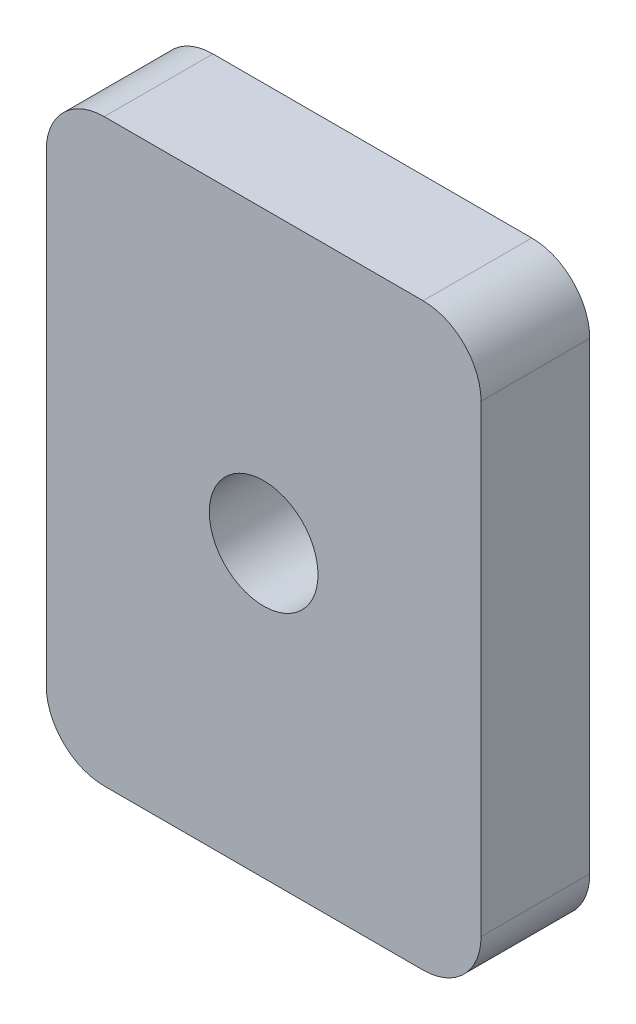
ISO-10303-21;
HEADER;
FILE_DESCRIPTION(('STEP AP214'),'2;1');
FILE_NAME('part.step','',(''),(''),'','','');
FILE_SCHEMA(('AUTOMOTIVE_DESIGN { 1 0 10303 214 1 1 1 1 }'));
ENDSEC;
DATA;
#1=APPLICATION_CONTEXT('core data for automotive mechanical design processes');
#2=APPLICATION_PROTOCOL_DEFINITION('international standard','automotive_design',2000,#1);
#3=PRODUCT_CONTEXT('',#1,'mechanical');
#4=PRODUCT('Part','Part','',(#3));
#5=PRODUCT_RELATED_PRODUCT_CATEGORY('part','',(#4));
#6=PRODUCT_DEFINITION_FORMATION('','',#4);
#7=PRODUCT_DEFINITION_CONTEXT('part definition',#1,'design');
#8=PRODUCT_DEFINITION('design','',#6,#7);
#9=PRODUCT_DEFINITION_SHAPE('','',#8);
#10=(LENGTH_UNIT() NAMED_UNIT(*) SI_UNIT(.MILLI.,.METRE.));
#11=(NAMED_UNIT(*) PLANE_ANGLE_UNIT() SI_UNIT($,.RADIAN.));
#12=(NAMED_UNIT(*) SI_UNIT($,.STERADIAN.) SOLID_ANGLE_UNIT());
#13=UNCERTAINTY_MEASURE_WITH_UNIT(LENGTH_MEASURE(1.E-05),#10,'distance_accuracy_value','');
#14=(GEOMETRIC_REPRESENTATION_CONTEXT(3) GLOBAL_UNCERTAINTY_ASSIGNED_CONTEXT((#13)) GLOBAL_UNIT_ASSIGNED_CONTEXT((#10,
#11,#12)) REPRESENTATION_CONTEXT('',''));
#15=CARTESIAN_POINT('',(0.,0.,0.));
#16=DIRECTION('',(0.,0.,1.));
#17=DIRECTION('',(1.,0.,0.));
#18=AXIS2_PLACEMENT_3D('',#15,#16,#17);
#19=CARTESIAN_POINT('',(0.,0.,4.7625));
#20=DIRECTION('',(0.,0.,-1.));
#21=DIRECTION('',(-1.,0.,0.));
#22=AXIS2_PLACEMENT_3D('',#19,#20,#21);
#23=PLANE('',#22);
#24=DIRECTION('',(0.,-1.,0.));
#25=VECTOR('',#24,1.);
#26=CARTESIAN_POINT('',(0.,0.,4.7625));
#27=LINE('',#26,#25);
#28=CARTESIAN_POINT('',(0.,22.86,4.7625));
#29=VERTEX_POINT('',#28);
#30=CARTESIAN_POINT('',(0.,2.54,4.7625));
#31=VERTEX_POINT('',#30);
#32=EDGE_CURVE('E136',#29,#31,#27,.T.);
#33=ORIENTED_EDGE('',*,*,#32,.T.);
#34=CARTESIAN_POINT('',(2.54,2.54,4.7625));
#35=DIRECTION('',(0.,0.,-1.));
#36=DIRECTION('',(-1.,0.,0.));
#37=AXIS2_PLACEMENT_3D('',#34,#35,#36);
#38=CIRCLE('',#37,2.54);
#39=CARTESIAN_POINT('',(2.54,0.,4.7625));
#40=VERTEX_POINT('',#39);
#41=EDGE_CURVE('E151',#31,#40,#38,.F.);
#42=ORIENTED_EDGE('',*,*,#41,.T.);
#43=DIRECTION('',(1.,0.,0.));
#44=VECTOR('',#43,1.);
#45=CARTESIAN_POINT('',(0.,0.,4.7625));
#46=LINE('',#45,#44);
#47=CARTESIAN_POINT('',(16.51,0.,4.7625));
#48=VERTEX_POINT('',#47);
#49=EDGE_CURVE('E118',#40,#48,#46,.T.);
#50=ORIENTED_EDGE('',*,*,#49,.T.);
#51=CARTESIAN_POINT('',(16.51,2.54,4.7625));
#52=DIRECTION('',(0.,0.,-1.));
#53=DIRECTION('',(-1.,0.,0.));
#54=AXIS2_PLACEMENT_3D('',#51,#52,#53);
#55=CIRCLE('',#54,2.54);
#56=CARTESIAN_POINT('',(19.05,2.54,4.7625));
#57=VERTEX_POINT('',#56);
#58=EDGE_CURVE('E149',#48,#57,#55,.F.);
#59=ORIENTED_EDGE('',*,*,#58,.T.);
#60=DIRECTION('',(0.,1.,0.));
#61=VECTOR('',#60,1.);
#62=CARTESIAN_POINT('',(19.05,0.,4.7625));
#63=LINE('',#62,#61);
#64=CARTESIAN_POINT('',(19.05,22.86,4.7625));
#65=VERTEX_POINT('',#64);
#66=EDGE_CURVE('E171',#57,#65,#63,.T.);
#67=ORIENTED_EDGE('',*,*,#66,.T.);
#68=CARTESIAN_POINT('',(16.51,22.86,4.7625));
#69=DIRECTION('',(0.,0.,-1.));
#70=DIRECTION('',(-1.,0.,0.));
#71=AXIS2_PLACEMENT_3D('',#68,#69,#70);
#72=CIRCLE('',#71,2.54);
#73=CARTESIAN_POINT('',(16.51,25.4,4.7625));
#74=VERTEX_POINT('',#73);
#75=EDGE_CURVE('E53',#65,#74,#72,.F.);
#76=ORIENTED_EDGE('',*,*,#75,.T.);
#77=DIRECTION('',(-1.,0.,0.));
#78=VECTOR('',#77,1.);
#79=CARTESIAN_POINT('',(0.,25.4,4.7625));
#80=LINE('',#79,#78);
#81=CARTESIAN_POINT('',(2.54,25.4,4.7625));
#82=VERTEX_POINT('',#81);
#83=EDGE_CURVE('E137',#74,#82,#80,.T.);
#84=ORIENTED_EDGE('',*,*,#83,.T.);
#85=CARTESIAN_POINT('',(2.54,22.86,4.7625));
#86=DIRECTION('',(0.,0.,-1.));
#87=DIRECTION('',(-1.,0.,0.));
#88=AXIS2_PLACEMENT_3D('',#85,#86,#87);
#89=CIRCLE('',#88,2.54);
#90=EDGE_CURVE('E147',#82,#29,#89,.F.);
#91=ORIENTED_EDGE('',*,*,#90,.T.);
#92=EDGE_LOOP('',(#33,#42,#50,#59,#67,#76,#84,#91));
#93=FACE_BOUND('',#92,.T.);
#94=CARTESIAN_POINT('',(9.525,12.7,4.7625));
#95=DIRECTION('',(0.,0.,1.));
#96=DIRECTION('',(1.,0.,0.));
#97=AXIS2_PLACEMENT_3D('',#94,#95,#96);
#98=CIRCLE('',#97,2.38125);
#99=CARTESIAN_POINT('',(7.14375,12.7,4.7625));
#100=VERTEX_POINT('',#99);
#101=EDGE_CURVE('E131',#100,#100,#98,.T.);
#102=ORIENTED_EDGE('',*,*,#101,.F.);
#103=EDGE_LOOP('',(#102));
#104=FACE_BOUND('',#103,.T.);
#105=ADVANCED_FACE('F33',(#93,#104),#23,.F.);
#106=CARTESIAN_POINT('',(0.,0.,0.));
#107=DIRECTION('',(0.,0.,-1.));
#108=DIRECTION('',(-1.,0.,0.));
#109=AXIS2_PLACEMENT_3D('',#106,#107,#108);
#110=PLANE('',#109);
#111=DIRECTION('',(1.,0.,0.));
#112=VECTOR('',#111,1.);
#113=CARTESIAN_POINT('',(0.,0.,0.));
#114=LINE('',#113,#112);
#115=CARTESIAN_POINT('',(2.54,0.,0.));
#116=VERTEX_POINT('',#115);
#117=CARTESIAN_POINT('',(16.51,0.,0.));
#118=VERTEX_POINT('',#117);
#119=EDGE_CURVE('E115',#116,#118,#114,.T.);
#120=ORIENTED_EDGE('',*,*,#119,.F.);
#121=CARTESIAN_POINT('',(2.54,2.54,0.));
#122=DIRECTION('',(0.,0.,-1.));
#123=DIRECTION('',(-1.,0.,0.));
#124=AXIS2_PLACEMENT_3D('',#121,#122,#123);
#125=CIRCLE('',#124,2.54);
#126=CARTESIAN_POINT('',(0.,2.54,0.));
#127=VERTEX_POINT('',#126);
#128=EDGE_CURVE('E98',#116,#127,#125,.T.);
#129=ORIENTED_EDGE('',*,*,#128,.T.);
#130=DIRECTION('',(0.,-1.,0.));
#131=VECTOR('',#130,1.);
#132=CARTESIAN_POINT('',(0.,0.,0.));
#133=LINE('',#132,#131);
#134=CARTESIAN_POINT('',(0.,22.86,0.));
#135=VERTEX_POINT('',#134);
#136=EDGE_CURVE('E126',#135,#127,#133,.T.);
#137=ORIENTED_EDGE('',*,*,#136,.F.);
#138=CARTESIAN_POINT('',(2.54,22.86,0.));
#139=DIRECTION('',(0.,0.,-1.));
#140=DIRECTION('',(-1.,0.,0.));
#141=AXIS2_PLACEMENT_3D('',#138,#139,#140);
#142=CIRCLE('',#141,2.54);
#143=CARTESIAN_POINT('',(2.54,25.4,0.));
#144=VERTEX_POINT('',#143);
#145=EDGE_CURVE('E140',#135,#144,#142,.T.);
#146=ORIENTED_EDGE('',*,*,#145,.T.);
#147=DIRECTION('',(-1.,0.,0.));
#148=VECTOR('',#147,1.);
#149=CARTESIAN_POINT('',(0.,25.4,0.));
#150=LINE('',#149,#148);
#151=CARTESIAN_POINT('',(16.51,25.4,0.));
#152=VERTEX_POINT('',#151);
#153=EDGE_CURVE('E129',#152,#144,#150,.T.);
#154=ORIENTED_EDGE('',*,*,#153,.F.);
#155=CARTESIAN_POINT('',(16.51,22.86,0.));
#156=DIRECTION('',(0.,0.,-1.));
#157=DIRECTION('',(-1.,0.,0.));
#158=AXIS2_PLACEMENT_3D('',#155,#156,#157);
#159=CIRCLE('',#158,2.54);
#160=CARTESIAN_POINT('',(19.05,22.86,0.));
#161=VERTEX_POINT('',#160);
#162=EDGE_CURVE('E119',#152,#161,#159,.T.);
#163=ORIENTED_EDGE('',*,*,#162,.T.);
#164=DIRECTION('',(0.,1.,0.));
#165=VECTOR('',#164,1.);
#166=CARTESIAN_POINT('',(19.05,0.,0.));
#167=LINE('',#166,#165);
#168=CARTESIAN_POINT('',(19.05,2.54,0.));
#169=VERTEX_POINT('',#168);
#170=EDGE_CURVE('E125',#169,#161,#167,.T.);
#171=ORIENTED_EDGE('',*,*,#170,.F.);
#172=CARTESIAN_POINT('',(16.51,2.54,0.));
#173=DIRECTION('',(0.,0.,-1.));
#174=DIRECTION('',(-1.,0.,0.));
#175=AXIS2_PLACEMENT_3D('',#172,#173,#174);
#176=CIRCLE('',#175,2.54);
#177=EDGE_CURVE('E109',#169,#118,#176,.T.);
#178=ORIENTED_EDGE('',*,*,#177,.T.);
#179=EDGE_LOOP('',(#120,#129,#137,#146,#154,#163,#171,#178));
#180=FACE_BOUND('',#179,.T.);
#181=CARTESIAN_POINT('',(9.525,12.7,0.));
#182=DIRECTION('',(0.,0.,1.));
#183=DIRECTION('',(1.,0.,0.));
#184=AXIS2_PLACEMENT_3D('',#181,#182,#183);
#185=CIRCLE('',#184,2.38125);
#186=CARTESIAN_POINT('',(7.14375,12.7,0.));
#187=VERTEX_POINT('',#186);
#188=EDGE_CURVE('E174',#187,#187,#185,.T.);
#189=ORIENTED_EDGE('',*,*,#188,.T.);
#190=EDGE_LOOP('',(#189));
#191=FACE_BOUND('',#190,.T.);
#192=ADVANCED_FACE('F122',(#180,#191),#110,.T.);
#193=CARTESIAN_POINT('',(0.,0.,4.7625));
#194=DIRECTION('',(1.,0.,0.));
#195=DIRECTION('',(0.,0.,-1.));
#196=AXIS2_PLACEMENT_3D('',#193,#194,#195);
#197=PLANE('',#196);
#198=ORIENTED_EDGE('',*,*,#136,.T.);
#199=DIRECTION('',(0.,0.,-1.));
#200=VECTOR('',#199,1.);
#201=CARTESIAN_POINT('',(0.,2.54,4.7625));
#202=LINE('',#201,#200);
#203=EDGE_CURVE('E103',#127,#31,#202,.F.);
#204=ORIENTED_EDGE('',*,*,#203,.T.);
#205=ORIENTED_EDGE('',*,*,#32,.F.);
#206=DIRECTION('',(0.,0.,-1.));
#207=VECTOR('',#206,1.);
#208=CARTESIAN_POINT('',(0.,22.86,4.7625));
#209=LINE('',#208,#207);
#210=EDGE_CURVE('E108',#29,#135,#209,.T.);
#211=ORIENTED_EDGE('',*,*,#210,.T.);
#212=EDGE_LOOP('',(#198,#204,#205,#211));
#213=FACE_BOUND('',#212,.T.);
#214=ADVANCED_FACE('F168',(#213),#197,.F.);
#215=CARTESIAN_POINT('',(0.,0.,4.7625));
#216=DIRECTION('',(0.,1.,0.));
#217=DIRECTION('',(0.,0.,1.));
#218=AXIS2_PLACEMENT_3D('',#215,#216,#217);
#219=PLANE('',#218);
#220=ORIENTED_EDGE('',*,*,#49,.F.);
#221=DIRECTION('',(0.,0.,-1.));
#222=VECTOR('',#221,1.);
#223=CARTESIAN_POINT('',(2.54,0.,4.7625));
#224=LINE('',#223,#222);
#225=EDGE_CURVE('E102',#40,#116,#224,.T.);
#226=ORIENTED_EDGE('',*,*,#225,.T.);
#227=ORIENTED_EDGE('',*,*,#119,.T.);
#228=DIRECTION('',(0.,0.,-1.));
#229=VECTOR('',#228,1.);
#230=CARTESIAN_POINT('',(16.51,0.,4.7625));
#231=LINE('',#230,#229);
#232=EDGE_CURVE('E120',#118,#48,#231,.F.);
#233=ORIENTED_EDGE('',*,*,#232,.T.);
#234=EDGE_LOOP('',(#220,#226,#227,#233));
#235=FACE_BOUND('',#234,.T.);
#236=ADVANCED_FACE('F114',(#235),#219,.F.);
#237=CARTESIAN_POINT('',(19.05,0.,4.7625));
#238=DIRECTION('',(-1.,0.,0.));
#239=DIRECTION('',(0.,0.,1.));
#240=AXIS2_PLACEMENT_3D('',#237,#238,#239);
#241=PLANE('',#240);
#242=ORIENTED_EDGE('',*,*,#66,.F.);
#243=DIRECTION('',(0.,0.,-1.));
#244=VECTOR('',#243,1.);
#245=CARTESIAN_POINT('',(19.05,2.54,4.7625));
#246=LINE('',#245,#244);
#247=EDGE_CURVE('E155',#57,#169,#246,.T.);
#248=ORIENTED_EDGE('',*,*,#247,.T.);
#249=ORIENTED_EDGE('',*,*,#170,.T.);
#250=DIRECTION('',(0.,0.,-1.));
#251=VECTOR('',#250,1.);
#252=CARTESIAN_POINT('',(19.05,22.86,4.7625));
#253=LINE('',#252,#251);
#254=EDGE_CURVE('E153',#161,#65,#253,.F.);
#255=ORIENTED_EDGE('',*,*,#254,.T.);
#256=EDGE_LOOP('',(#242,#248,#249,#255));
#257=FACE_BOUND('',#256,.T.);
#258=ADVANCED_FACE('F195',(#257),#241,.F.);
#259=CARTESIAN_POINT('',(0.,25.4,4.7625));
#260=DIRECTION('',(0.,-1.,0.));
#261=DIRECTION('',(0.,0.,-1.));
#262=AXIS2_PLACEMENT_3D('',#259,#260,#261);
#263=PLANE('',#262);
#264=ORIENTED_EDGE('',*,*,#153,.T.);
#265=DIRECTION('',(0.,0.,-1.));
#266=VECTOR('',#265,1.);
#267=CARTESIAN_POINT('',(2.54,25.4,4.7625));
#268=LINE('',#267,#266);
#269=EDGE_CURVE('E11',#144,#82,#268,.F.);
#270=ORIENTED_EDGE('',*,*,#269,.T.);
#271=ORIENTED_EDGE('',*,*,#83,.F.);
#272=DIRECTION('',(0.,0.,-1.));
#273=VECTOR('',#272,1.);
#274=CARTESIAN_POINT('',(16.51,25.4,4.7625));
#275=LINE('',#274,#273);
#276=EDGE_CURVE('E41',#74,#152,#275,.T.);
#277=ORIENTED_EDGE('',*,*,#276,.T.);
#278=EDGE_LOOP('',(#264,#270,#271,#277));
#279=FACE_BOUND('',#278,.T.);
#280=ADVANCED_FACE('F160',(#279),#263,.F.);
#281=CARTESIAN_POINT('',(9.525,12.7,4.7625));
#282=DIRECTION('',(0.,0.,-1.));
#283=DIRECTION('',(-1.,0.,0.));
#284=AXIS2_PLACEMENT_3D('',#281,#282,#283);
#285=CYLINDRICAL_SURFACE('',#284,2.38125);
#286=CARTESIAN_POINT('',(7.14375,12.7,4.7625));
#287=CARTESIAN_POINT('',(7.14375,12.7,4.712890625));
#288=CARTESIAN_POINT('',(7.14375,12.7,4.66328125));
#289=CARTESIAN_POINT('',(7.14375,12.7,4.5640625));
#290=CARTESIAN_POINT('',(7.14375,12.7,4.514453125));
#291=CARTESIAN_POINT('',(7.14375,12.7,4.415234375));
#292=CARTESIAN_POINT('',(7.14375,12.7,4.365625));
#293=CARTESIAN_POINT('',(7.14375,12.7,4.26640625));
#294=CARTESIAN_POINT('',(7.14375,12.7,4.216796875));
#295=CARTESIAN_POINT('',(7.14375,12.7,4.117578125));
#296=CARTESIAN_POINT('',(7.14375,12.7,4.06796875));
#297=CARTESIAN_POINT('',(7.14375,12.7,3.96875));
#298=CARTESIAN_POINT('',(7.14375,12.7,3.919140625));
#299=CARTESIAN_POINT('',(7.14375,12.7,3.819921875));
#300=CARTESIAN_POINT('',(7.14375,12.7,3.7703125));
#301=CARTESIAN_POINT('',(7.14375,12.7,3.67109375));
#302=CARTESIAN_POINT('',(7.14375,12.7,3.621484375));
#303=CARTESIAN_POINT('',(7.14375,12.7,3.522265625));
#304=CARTESIAN_POINT('',(7.14375,12.7,3.47265625));
#305=CARTESIAN_POINT('',(7.14375,12.7,3.3734375));
#306=CARTESIAN_POINT('',(7.14375,12.7,3.323828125));
#307=CARTESIAN_POINT('',(7.14375,12.7,3.224609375));
#308=CARTESIAN_POINT('',(7.14375,12.7,3.175));
#309=CARTESIAN_POINT('',(7.14375,12.7,3.07578125));
#310=CARTESIAN_POINT('',(7.14375,12.7,3.026171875));
#311=CARTESIAN_POINT('',(7.14375,12.7,2.926953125));
#312=CARTESIAN_POINT('',(7.14375,12.7,2.87734375));
#313=CARTESIAN_POINT('',(7.14375,12.7,2.778125));
#314=CARTESIAN_POINT('',(7.14375,12.7,2.728515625));
#315=CARTESIAN_POINT('',(7.14375,12.7,2.629296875));
#316=CARTESIAN_POINT('',(7.14375,12.7,2.5796875));
#317=CARTESIAN_POINT('',(7.14375,12.7,2.48046875));
#318=CARTESIAN_POINT('',(7.14375,12.7,2.430859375));
#319=CARTESIAN_POINT('',(7.14375,12.7,2.331640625));
#320=CARTESIAN_POINT('',(7.14375,12.7,2.28203125));
#321=CARTESIAN_POINT('',(7.14375,12.7,2.1828125));
#322=CARTESIAN_POINT('',(7.14375,12.7,2.133203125));
#323=CARTESIAN_POINT('',(7.14375,12.7,2.033984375));
#324=CARTESIAN_POINT('',(7.14375,12.7,1.984375));
#325=CARTESIAN_POINT('',(7.14375,12.7,1.88515625));
#326=CARTESIAN_POINT('',(7.14375,12.7,1.835546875));
#327=CARTESIAN_POINT('',(7.14375,12.7,1.736328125));
#328=CARTESIAN_POINT('',(7.14375,12.7,1.68671875));
#329=CARTESIAN_POINT('',(7.14375,12.7,1.5875));
#330=CARTESIAN_POINT('',(7.14375,12.7,1.537890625));
#331=CARTESIAN_POINT('',(7.14375,12.7,1.438671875));
#332=CARTESIAN_POINT('',(7.14375,12.7,1.3890625));
#333=CARTESIAN_POINT('',(7.14375,12.7,1.28984375));
#334=CARTESIAN_POINT('',(7.14375,12.7,1.240234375));
#335=CARTESIAN_POINT('',(7.14375,12.7,1.141015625));
#336=CARTESIAN_POINT('',(7.14375,12.7,1.09140625));
#337=CARTESIAN_POINT('',(7.14375,12.7,0.992187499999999));
#338=CARTESIAN_POINT('',(7.14375,12.7,0.942578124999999));
#339=CARTESIAN_POINT('',(7.14375,12.7,0.843359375));
#340=CARTESIAN_POINT('',(7.14375,12.7,0.79375));
#341=CARTESIAN_POINT('',(7.14375,12.7,0.69453125));
#342=CARTESIAN_POINT('',(7.14375,12.7,0.644921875));
#343=CARTESIAN_POINT('',(7.14375,12.7,0.545703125));
#344=CARTESIAN_POINT('',(7.14375,12.7,0.49609375));
#345=CARTESIAN_POINT('',(7.14375,12.7,0.396875));
#346=CARTESIAN_POINT('',(7.14375,12.7,0.347265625));
#347=CARTESIAN_POINT('',(7.14375,12.7,0.248046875));
#348=CARTESIAN_POINT('',(7.14375,12.7,0.1984375));
#349=CARTESIAN_POINT('',(7.14375,12.7,0.09921875));
#350=CARTESIAN_POINT('',(7.14375,12.7,0.049609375));
#351=CARTESIAN_POINT('',(7.14375,12.7,0.));
#352=B_SPLINE_CURVE_WITH_KNOTS('',3,(#286,#287,#288,#289,#290,#291,#292,#293,#294,#295,#296,
#297,#298,#299,#300,#301,#302,#303,#304,#305,#306,#307,#308,#309,#310,#311,#312,#313,#314,#315,
#316,#317,#318,#319,#320,#321,#322,#323,#324,#325,#326,#327,#328,#329,#330,#331,#332,#333,#334,
#335,#336,#337,#338,#339,#340,#341,#342,#343,#344,#345,#346,#347,#348,#349,#350,#351),
.UNSPECIFIED.,.F.,.F.,(4,2,2,2,2,2,2,2,2,2,2,2,2,2,2,2,2,2,2,2,2,2,2,2,2,2,2,2,2,2,2,2,4),(0.,
0.148828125,0.29765625,0.446484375,0.5953125,0.744140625,0.892968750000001,1.041796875,1.190625,
1.339453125,1.48828125,1.637109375,1.7859375,1.934765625,2.08359375,2.232421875,2.38125,
2.530078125,2.67890625,2.827734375,2.9765625,3.125390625,3.27421875,3.423046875,3.571875,
3.720703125,3.86953125,4.018359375,4.1671875,4.316015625,4.46484375,4.613671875,4.7625),.UNSPECIFIED.);
#353=EDGE_CURVE('BSEAM186',#100,#187,#352,.T.);
#354=ORIENTED_EDGE('',*,*,#101,.T.);
#355=ORIENTED_EDGE('',*,*,#188,.F.);
#356=ORIENTED_EDGE('',*,*,#353,.T.);
#357=ORIENTED_EDGE('',*,*,#353,.F.);
#358=EDGE_LOOP('',(#354,#356,#355,#357));
#359=FACE_BOUND('',#358,.T.);
#360=ADVANCED_FACE('F186',(#359),#285,.F.);
#361=CARTESIAN_POINT('',(2.54,2.54,4.7625));
#362=DIRECTION('',(0.,0.,-1.));
#363=DIRECTION('',(-1.,0.,0.));
#364=AXIS2_PLACEMENT_3D('',#361,#362,#363);
#365=CYLINDRICAL_SURFACE('',#364,2.54);
#366=ORIENTED_EDGE('',*,*,#41,.F.);
#367=ORIENTED_EDGE('',*,*,#203,.F.);
#368=ORIENTED_EDGE('',*,*,#128,.F.);
#369=ORIENTED_EDGE('',*,*,#225,.F.);
#370=EDGE_LOOP('',(#366,#367,#368,#369));
#371=FACE_BOUND('',#370,.T.);
#372=ADVANCED_FACE('F101',(#371),#365,.T.);
#373=CARTESIAN_POINT('',(16.51,2.54,4.7625));
#374=DIRECTION('',(0.,0.,-1.));
#375=DIRECTION('',(-1.,0.,0.));
#376=AXIS2_PLACEMENT_3D('',#373,#374,#375);
#377=CYLINDRICAL_SURFACE('',#376,2.54);
#378=ORIENTED_EDGE('',*,*,#58,.F.);
#379=ORIENTED_EDGE('',*,*,#232,.F.);
#380=ORIENTED_EDGE('',*,*,#177,.F.);
#381=ORIENTED_EDGE('',*,*,#247,.F.);
#382=EDGE_LOOP('',(#378,#379,#380,#381));
#383=FACE_BOUND('',#382,.T.);
#384=ADVANCED_FACE('F193',(#383),#377,.T.);
#385=CARTESIAN_POINT('',(2.54,22.86,4.7625));
#386=DIRECTION('',(0.,0.,-1.));
#387=DIRECTION('',(-1.,0.,0.));
#388=AXIS2_PLACEMENT_3D('',#385,#386,#387);
#389=CYLINDRICAL_SURFACE('',#388,2.54);
#390=ORIENTED_EDGE('',*,*,#90,.F.);
#391=ORIENTED_EDGE('',*,*,#269,.F.);
#392=ORIENTED_EDGE('',*,*,#145,.F.);
#393=ORIENTED_EDGE('',*,*,#210,.F.);
#394=EDGE_LOOP('',(#390,#391,#392,#393));
#395=FACE_BOUND('',#394,.T.);
#396=ADVANCED_FACE('F165',(#395),#389,.T.);
#397=CARTESIAN_POINT('',(16.51,22.86,4.7625));
#398=DIRECTION('',(0.,0.,-1.));
#399=DIRECTION('',(-1.,0.,0.));
#400=AXIS2_PLACEMENT_3D('',#397,#398,#399);
#401=CYLINDRICAL_SURFACE('',#400,2.54);
#402=ORIENTED_EDGE('',*,*,#75,.F.);
#403=ORIENTED_EDGE('',*,*,#254,.F.);
#404=ORIENTED_EDGE('',*,*,#162,.F.);
#405=ORIENTED_EDGE('',*,*,#276,.F.);
#406=EDGE_LOOP('',(#402,#403,#404,#405));
#407=FACE_BOUND('',#406,.T.);
#408=ADVANCED_FACE('F35',(#407),#401,.T.);
#409=CLOSED_SHELL('',(#105,#192,#214,#236,#258,#280,#360,#372,#384,#396,#408));
#410=MANIFOLD_SOLID_BREP('B2',#409);
#411=ADVANCED_BREP_SHAPE_REPRESENTATION('',(#18,#410),#14);
#412=SHAPE_DEFINITION_REPRESENTATION(#9,#411);
ENDSEC;
END-ISO-10303-21;
